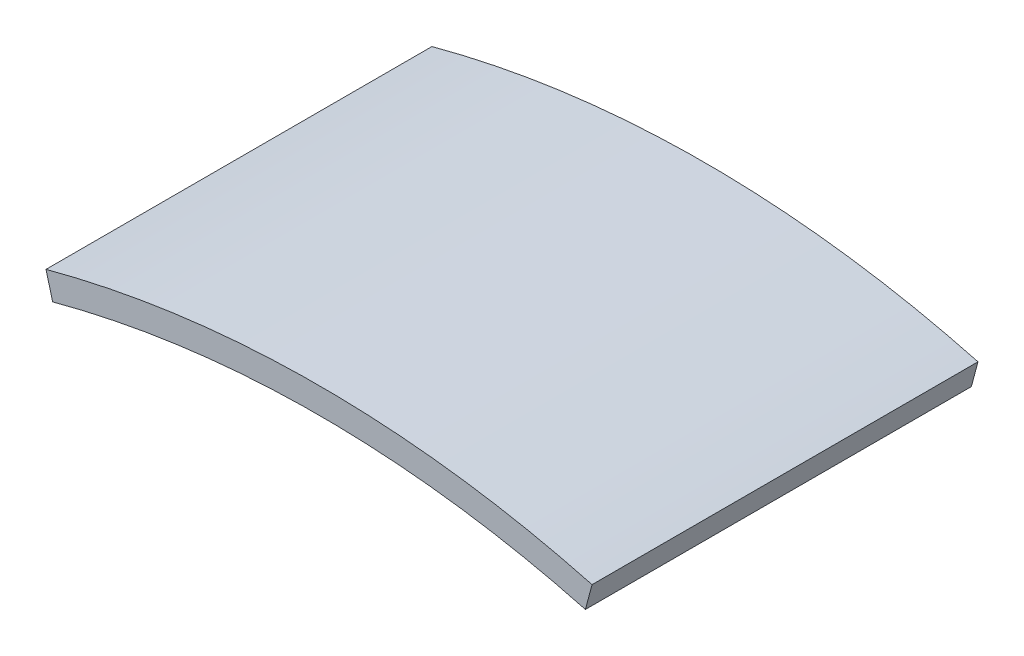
ISO-10303-21;
HEADER;
FILE_DESCRIPTION(('STEP AP214'),'2;1');
FILE_NAME('part.step','',(''),(''),'','','');
FILE_SCHEMA(('AUTOMOTIVE_DESIGN { 1 0 10303 214 1 1 1 1 }'));
ENDSEC;
DATA;
#1=APPLICATION_CONTEXT('core data for automotive mechanical design processes');
#2=APPLICATION_PROTOCOL_DEFINITION('international standard','automotive_design',2000,#1);
#3=PRODUCT_CONTEXT('',#1,'mechanical');
#4=PRODUCT('Part','Part','',(#3));
#5=PRODUCT_RELATED_PRODUCT_CATEGORY('part','',(#4));
#6=PRODUCT_DEFINITION_FORMATION('','',#4);
#7=PRODUCT_DEFINITION_CONTEXT('part definition',#1,'design');
#8=PRODUCT_DEFINITION('design','',#6,#7);
#9=PRODUCT_DEFINITION_SHAPE('','',#8);
#10=(LENGTH_UNIT() NAMED_UNIT(*) SI_UNIT(.MILLI.,.METRE.));
#11=(NAMED_UNIT(*) PLANE_ANGLE_UNIT() SI_UNIT($,.RADIAN.));
#12=(NAMED_UNIT(*) SI_UNIT($,.STERADIAN.) SOLID_ANGLE_UNIT());
#13=UNCERTAINTY_MEASURE_WITH_UNIT(LENGTH_MEASURE(1.E-05),#10,'distance_accuracy_value','');
#14=(GEOMETRIC_REPRESENTATION_CONTEXT(3) GLOBAL_UNCERTAINTY_ASSIGNED_CONTEXT((#13)) GLOBAL_UNIT_ASSIGNED_CONTEXT((#10,
#11,#12)) REPRESENTATION_CONTEXT('',''));
#15=CARTESIAN_POINT('',(0.,0.,0.));
#16=DIRECTION('',(0.,0.,1.));
#17=DIRECTION('',(1.,0.,0.));
#18=AXIS2_PLACEMENT_3D('',#15,#16,#17);
#19=CARTESIAN_POINT('',(40.,0.,15.));
#20=DIRECTION('',(0.,0.,-1.));
#21=DIRECTION('',(-1.,0.,0.));
#22=AXIS2_PLACEMENT_3D('',#19,#20,#21);
#23=CYLINDRICAL_SURFACE('',#22,41.);
#24=CARTESIAN_POINT('',(40.,0.,0.));
#25=DIRECTION('',(0.,0.,1.));
#26=DIRECTION('',(-1.,0.,0.));
#27=AXIS2_PLACEMENT_3D('',#24,#25,#26);
#28=CIRCLE('',#27,41.);
#29=CARTESIAN_POINT('',(50.6115808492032,39.6029588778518,0.));
#30=VERTEX_POINT('',#29);
#31=CARTESIAN_POINT('',(29.3884191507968,39.6029588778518,0.));
#32=VERTEX_POINT('',#31);
#33=EDGE_CURVE('E105',#30,#32,#28,.T.);
#34=ORIENTED_EDGE('',*,*,#33,.T.);
#35=DIRECTION('',(0.,0.,-1.));
#36=VECTOR('',#35,1.);
#37=CARTESIAN_POINT('',(29.3884191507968,39.6029588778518,15.));
#38=LINE('',#37,#36);
#39=CARTESIAN_POINT('',(29.3884191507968,39.6029588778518,15.));
#40=VERTEX_POINT('',#39);
#41=EDGE_CURVE('E100',#40,#32,#38,.T.);
#42=ORIENTED_EDGE('',*,*,#41,.F.);
#43=CARTESIAN_POINT('',(40.,0.,15.));
#44=DIRECTION('',(0.,0.,1.));
#45=DIRECTION('',(-1.,0.,0.));
#46=AXIS2_PLACEMENT_3D('',#43,#44,#45);
#47=CIRCLE('',#46,41.);
#48=CARTESIAN_POINT('',(50.6115808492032,39.6029588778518,15.));
#49=VERTEX_POINT('',#48);
#50=EDGE_CURVE('E126',#49,#40,#47,.T.);
#51=ORIENTED_EDGE('',*,*,#50,.F.);
#52=DIRECTION('',(0.,0.,-1.));
#53=VECTOR('',#52,1.);
#54=CARTESIAN_POINT('',(50.6115808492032,39.6029588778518,15.));
#55=LINE('',#54,#53);
#56=EDGE_CURVE('E121',#49,#30,#55,.T.);
#57=ORIENTED_EDGE('',*,*,#56,.T.);
#58=EDGE_LOOP('',(#34,#42,#51,#57));
#59=FACE_BOUND('',#58,.T.);
#60=ADVANCED_FACE('F36',(#59),#23,.T.);
#61=CARTESIAN_POINT('',(29.6472381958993,38.6370330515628,15.));
#62=DIRECTION('',(0.965925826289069,0.258819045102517,0.));
#63=DIRECTION('',(-0.258819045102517,0.965925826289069,0.));
#64=AXIS2_PLACEMENT_3D('',#61,#62,#63);
#65=PLANE('',#64);
#66=DIRECTION('',(0.258819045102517,-0.965925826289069,0.));
#67=VECTOR('',#66,1.);
#68=CARTESIAN_POINT('',(29.6472381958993,38.6370330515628,0.));
#69=LINE('',#68,#67);
#70=CARTESIAN_POINT('',(29.6472381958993,38.6370330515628,0.));
#71=VERTEX_POINT('',#70);
#72=EDGE_CURVE('E119',#32,#71,#69,.T.);
#73=ORIENTED_EDGE('',*,*,#72,.T.);
#74=DIRECTION('',(0.,0.,-1.));
#75=VECTOR('',#74,1.);
#76=CARTESIAN_POINT('',(29.6472381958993,38.6370330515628,15.));
#77=LINE('',#76,#75);
#78=CARTESIAN_POINT('',(29.6472381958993,38.6370330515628,15.));
#79=VERTEX_POINT('',#78);
#80=EDGE_CURVE('E117',#79,#71,#77,.T.);
#81=ORIENTED_EDGE('',*,*,#80,.F.);
#82=DIRECTION('',(0.258819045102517,-0.965925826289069,0.));
#83=VECTOR('',#82,1.);
#84=CARTESIAN_POINT('',(29.6472381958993,38.6370330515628,15.));
#85=LINE('',#84,#83);
#86=EDGE_CURVE('E91',#40,#79,#85,.T.);
#87=ORIENTED_EDGE('',*,*,#86,.F.);
#88=ORIENTED_EDGE('',*,*,#41,.T.);
#89=EDGE_LOOP('',(#73,#81,#87,#88));
#90=FACE_BOUND('',#89,.T.);
#91=ADVANCED_FACE('F110',(#90),#65,.F.);
#92=CARTESIAN_POINT('',(40.,0.,15.));
#93=DIRECTION('',(0.,0.,-1.));
#94=DIRECTION('',(-1.,0.,0.));
#95=AXIS2_PLACEMENT_3D('',#92,#93,#94);
#96=CYLINDRICAL_SURFACE('',#95,40.);
#97=CARTESIAN_POINT('',(40.,40.,5.00000152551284));
#98=CARTESIAN_POINT('',(39.8597206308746,39.9999989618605,5.0001626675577));
#99=CARTESIAN_POINT('',(39.7193561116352,39.9992541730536,5.01215823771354));
#100=CARTESIAN_POINT('',(39.4425290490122,39.9963554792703,5.05952823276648));
#101=CARTESIAN_POINT('',(39.3060712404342,39.9941999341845,5.0949298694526));
#102=CARTESIAN_POINT('',(39.041107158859,39.9887243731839,5.18809109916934));
#103=CARTESIAN_POINT('',(38.9125967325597,39.9854049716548,5.24583889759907));
#104=CARTESIAN_POINT('',(38.6671267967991,39.9779757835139,5.38203416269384));
#105=CARTESIAN_POINT('',(38.5501646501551,39.9738661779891,5.46047688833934));
#106=CARTESIAN_POINT('',(38.3309027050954,39.9653123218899,5.63596407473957));
#107=CARTESIAN_POINT('',(38.2286224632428,39.9608676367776,5.73303295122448));
#108=CARTESIAN_POINT('',(38.0417946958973,39.9521488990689,5.94296647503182));
#109=CARTESIAN_POINT('',(37.9572479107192,39.9478748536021,6.05583178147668));
#110=CARTESIAN_POINT('',(37.8082274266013,39.9399765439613,6.29426431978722));
#111=CARTESIAN_POINT('',(37.7437698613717,39.9363528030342,6.41984165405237));
#112=CARTESIAN_POINT('',(37.6368606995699,39.9301697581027,6.68006247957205));
#113=CARTESIAN_POINT('',(37.5944088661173,39.9276104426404,6.8147058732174));
#114=CARTESIAN_POINT('',(37.532770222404,39.9238492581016,7.08904835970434));
#115=CARTESIAN_POINT('',(37.5135527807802,39.9226456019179,7.22874054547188));
#116=CARTESIAN_POINT('',(37.4988340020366,39.9217262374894,7.50937275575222));
#117=CARTESIAN_POINT('',(37.5033323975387,39.9220105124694,7.65031276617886));
#118=CARTESIAN_POINT('',(37.5358920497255,39.9240332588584,7.92923247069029));
#119=CARTESIAN_POINT('',(37.5639203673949,39.925769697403,8.06721602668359));
#120=CARTESIAN_POINT('',(37.6426933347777,39.9304977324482,8.33651603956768));
#121=CARTESIAN_POINT('',(37.6934381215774,39.9334893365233,8.46783245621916));
#122=CARTESIAN_POINT('',(37.8162416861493,39.9403926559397,8.72017772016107));
#123=CARTESIAN_POINT('',(37.8883156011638,39.9443050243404,8.84119918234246));
#124=CARTESIAN_POINT('',(38.0517204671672,39.9526078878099,9.06943838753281));
#125=CARTESIAN_POINT('',(38.1430516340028,39.9569983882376,9.17665597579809));
#126=CARTESIAN_POINT('',(38.3425646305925,39.9657712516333,9.37443573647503));
#127=CARTESIAN_POINT('',(38.4507749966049,39.9701535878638,9.4649691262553));
#128=CARTESIAN_POINT('',(38.6808742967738,39.9784084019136,9.62658881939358));
#129=CARTESIAN_POINT('',(38.8027632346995,39.9822808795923,9.69767511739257));
#130=CARTESIAN_POINT('',(39.0567757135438,39.9890791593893,9.81837955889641));
#131=CARTESIAN_POINT('',(39.1888996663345,39.9920049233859,9.8679968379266));
#132=CARTESIAN_POINT('',(39.4596248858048,39.9965787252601,9.94433664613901));
#133=CARTESIAN_POINT('',(39.5982260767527,39.9982267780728,9.97105944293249));
#134=CARTESIAN_POINT('',(39.8777209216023,40.0000567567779,10.0008163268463));
#135=CARTESIAN_POINT('',(40.0186103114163,40.0002411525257,10.0038903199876));
#136=CARTESIAN_POINT('',(40.2989025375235,39.9991287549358,9.98636645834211));
#137=CARTESIAN_POINT('',(40.4383053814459,39.9978319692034,9.9657687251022));
#138=CARTESIAN_POINT('',(40.7115566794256,39.9939039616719,9.90151897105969));
#139=CARTESIAN_POINT('',(40.8454093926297,39.9912737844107,9.85788499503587));
#140=CARTESIAN_POINT('',(41.1038920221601,39.9849740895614,9.74881966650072));
#141=CARTESIAN_POINT('',(41.2285218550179,39.9813045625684,9.68338811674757));
#142=CARTESIAN_POINT('',(41.4652044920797,39.9733315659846,9.53248262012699));
#143=CARTESIAN_POINT('',(41.5772401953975,39.9690272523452,9.44698189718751));
#144=CARTESIAN_POINT('',(41.7853823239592,39.9602713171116,9.25840430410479));
#145=CARTESIAN_POINT('',(41.8814885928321,39.9558196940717,9.155327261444));
#146=CARTESIAN_POINT('',(42.0551781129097,39.9472631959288,8.93435135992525));
#147=CARTESIAN_POINT('',(42.132735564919,39.9431588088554,8.81643220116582));
#148=CARTESIAN_POINT('',(42.2669495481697,39.9357668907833,8.56922172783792));
#149=CARTESIAN_POINT('',(42.3236062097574,39.9324793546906,8.4399304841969));
#150=CARTESIAN_POINT('',(42.4143650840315,39.9270950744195,8.17374200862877));
#151=CARTESIAN_POINT('',(42.4484838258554,39.9249974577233,8.03685043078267));
#152=CARTESIAN_POINT('',(42.4932524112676,39.9222269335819,7.75926820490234));
#153=CARTESIAN_POINT('',(42.503902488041,39.921554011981,7.61857759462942));
#154=CARTESIAN_POINT('',(42.5014295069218,39.921709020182,7.3376485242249));
#155=CARTESIAN_POINT('',(42.4883471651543,39.9225343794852,7.19740970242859));
#156=CARTESIAN_POINT('',(42.4388649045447,39.925587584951,6.92112408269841));
#157=CARTESIAN_POINT('',(42.4024649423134,39.9278154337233,6.78507729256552));
#158=CARTESIAN_POINT('',(42.3073894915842,39.9334221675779,6.52103030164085));
#159=CARTESIAN_POINT('',(42.2487139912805,39.9368010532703,6.39303010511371));
#160=CARTESIAN_POINT('',(42.1107586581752,39.9443293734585,6.14869250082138));
#161=CARTESIAN_POINT('',(42.0314793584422,39.9484787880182,6.0323547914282));
#162=CARTESIAN_POINT('',(41.8544158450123,39.9570893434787,5.81443789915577));
#163=CARTESIAN_POINT('',(41.7566021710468,39.9615509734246,5.71288267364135));
#164=CARTESIAN_POINT('',(41.545286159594,39.970279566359,5.52759879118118));
#165=CARTESIAN_POINT('',(41.4317799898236,39.9745464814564,5.44387450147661));
#166=CARTESIAN_POINT('',(41.1921722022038,39.9824099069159,5.29656779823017));
#167=CARTESIAN_POINT('',(41.0660552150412,39.9860055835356,5.23301036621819));
#168=CARTESIAN_POINT('',(40.8050093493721,39.992110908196,5.12805042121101));
#169=CARTESIAN_POINT('',(40.6700910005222,39.994621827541,5.08662196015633));
#170=CARTESIAN_POINT('',(40.4452897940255,39.9976175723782,5.03784715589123));
#171=CARTESIAN_POINT('',(40.356852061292,39.9985070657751,5.02358686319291));
#172=CARTESIAN_POINT('',(40.1789544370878,39.9996986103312,5.00461265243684));
#173=CARTESIAN_POINT('',(40.0894945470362,40.0000006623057,4.99989872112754));
#174=CARTESIAN_POINT('',(40.,40.,5.00000152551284));
#175=B_SPLINE_CURVE_WITH_KNOTS('',3,(#97,#98,#99,#100,#101,#102,#103,#104,#105,#106,#107,#108,
#109,#110,#111,#112,#113,#114,#115,#116,#117,#118,#119,#120,#121,#122,#123,#124,#125,#126,#127,
#128,#129,#130,#131,#132,#133,#134,#135,#136,#137,#138,#139,#140,#141,#142,#143,#144,#145,#146,
#147,#148,#149,#150,#151,#152,#153,#154,#155,#156,#157,#158,#159,#160,#161,#162,#163,#164,#165,
#166,#167,#168,#169,#170,#171,#172,#173,#174),.UNSPECIFIED.,.T.,.F.,(4,2,2,2,2,2,2,2,2,2,2,2,2,
2,2,2,2,2,2,2,2,2,2,2,2,2,2,2,2,2,2,2,2,2,2,2,2,2,4),(0.,0.420511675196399,0.841513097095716,
1.26229261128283,1.68297581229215,2.10421427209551,2.5254703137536,2.94706380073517,
3.3686527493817,3.78968528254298,4.21071306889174,4.63115244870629,5.05159436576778,
5.47233538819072,5.89308112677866,6.31454605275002,6.73601109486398,7.1574931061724,
7.57897019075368,7.99973590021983,8.42049944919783,8.84093389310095,9.26137214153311,
9.6823745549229,10.103381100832,10.5249698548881,10.9465559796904,11.367832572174,
11.7891049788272,12.2096553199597,12.6302064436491,13.0507577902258,13.4712982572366,
13.8925128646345,14.3138305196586,14.7356680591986,15.1570098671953,15.4252856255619,
15.6935610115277),.UNSPECIFIED.);
#176=CARTESIAN_POINT('',(40.,40.,9.99999847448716));
#177=VERTEX_POINT('',#176);
#178=CARTESIAN_POINT('',(40.,40.,5.00000152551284));
#179=VERTEX_POINT('',#178);
#180=EDGE_CURVE('E39',#177,#179,#175,.T.);
#181=ORIENTED_EDGE('',*,*,#180,.T.);
#182=EDGE_CURVE('E11',#179,#177,#175,.T.);
#183=ORIENTED_EDGE('',*,*,#182,.T.);
#184=EDGE_LOOP('',(#181,#183));
#185=FACE_BOUND('',#184,.T.);
#186=CARTESIAN_POINT('',(40.,0.,0.));
#187=DIRECTION('',(0.,0.,-1.));
#188=DIRECTION('',(-1.,0.,0.));
#189=AXIS2_PLACEMENT_3D('',#186,#187,#188);
#190=CIRCLE('',#189,40.);
#191=CARTESIAN_POINT('',(50.3527618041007,38.6370330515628,0.));
#192=VERTEX_POINT('',#191);
#193=EDGE_CURVE('E114',#71,#192,#190,.T.);
#194=ORIENTED_EDGE('',*,*,#193,.T.);
#195=DIRECTION('',(0.,0.,-1.));
#196=VECTOR('',#195,1.);
#197=CARTESIAN_POINT('',(50.3527618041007,38.6370330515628,15.));
#198=LINE('',#197,#196);
#199=CARTESIAN_POINT('',(50.3527618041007,38.6370330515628,15.));
#200=VERTEX_POINT('',#199);
#201=EDGE_CURVE('E116',#200,#192,#198,.T.);
#202=ORIENTED_EDGE('',*,*,#201,.F.);
#203=CARTESIAN_POINT('',(40.,0.,15.));
#204=DIRECTION('',(0.,0.,-1.));
#205=DIRECTION('',(-1.,0.,0.));
#206=AXIS2_PLACEMENT_3D('',#203,#204,#205);
#207=CIRCLE('',#206,40.);
#208=EDGE_CURVE('E138',#79,#200,#207,.T.);
#209=ORIENTED_EDGE('',*,*,#208,.F.);
#210=ORIENTED_EDGE('',*,*,#80,.T.);
#211=EDGE_LOOP('',(#194,#202,#209,#210));
#212=FACE_BOUND('',#211,.T.);
#213=ADVANCED_FACE('F106',(#185,#212),#96,.F.);
#214=CARTESIAN_POINT('',(50.3527618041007,38.6370330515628,15.));
#215=DIRECTION('',(-0.965925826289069,0.258819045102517,0.));
#216=DIRECTION('',(-0.258819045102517,-0.965925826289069,0.));
#217=AXIS2_PLACEMENT_3D('',#214,#215,#216);
#218=PLANE('',#217);
#219=DIRECTION('',(0.258819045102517,0.965925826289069,0.));
#220=VECTOR('',#219,1.);
#221=CARTESIAN_POINT('',(50.3527618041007,38.6370330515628,0.));
#222=LINE('',#221,#220);
#223=EDGE_CURVE('E83',#192,#30,#222,.T.);
#224=ORIENTED_EDGE('',*,*,#223,.T.);
#225=ORIENTED_EDGE('',*,*,#56,.F.);
#226=DIRECTION('',(0.258819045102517,0.965925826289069,0.));
#227=VECTOR('',#226,1.);
#228=CARTESIAN_POINT('',(50.3527618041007,38.6370330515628,15.));
#229=LINE('',#228,#227);
#230=EDGE_CURVE('E62',#200,#49,#229,.T.);
#231=ORIENTED_EDGE('',*,*,#230,.F.);
#232=ORIENTED_EDGE('',*,*,#201,.T.);
#233=EDGE_LOOP('',(#224,#225,#231,#232));
#234=FACE_BOUND('',#233,.T.);
#235=ADVANCED_FACE('F109',(#234),#218,.F.);
#236=CARTESIAN_POINT('',(40.,0.,15.));
#237=DIRECTION('',(0.,0.,-1.));
#238=DIRECTION('',(-1.,0.,0.));
#239=AXIS2_PLACEMENT_3D('',#236,#237,#238);
#240=PLANE('',#239);
#241=ORIENTED_EDGE('',*,*,#50,.T.);
#242=ORIENTED_EDGE('',*,*,#86,.T.);
#243=ORIENTED_EDGE('',*,*,#208,.T.);
#244=ORIENTED_EDGE('',*,*,#230,.T.);
#245=EDGE_LOOP('',(#241,#242,#243,#244));
#246=FACE_BOUND('',#245,.T.);
#247=ADVANCED_FACE('F140',(#246),#240,.F.);
#248=CARTESIAN_POINT('',(40.,0.,0.));
#249=DIRECTION('',(0.,0.,-1.));
#250=DIRECTION('',(-1.,0.,0.));
#251=AXIS2_PLACEMENT_3D('',#248,#249,#250);
#252=PLANE('',#251);
#253=ORIENTED_EDGE('',*,*,#33,.F.);
#254=ORIENTED_EDGE('',*,*,#223,.F.);
#255=ORIENTED_EDGE('',*,*,#193,.F.);
#256=ORIENTED_EDGE('',*,*,#72,.F.);
#257=EDGE_LOOP('',(#253,#254,#255,#256));
#258=FACE_BOUND('',#257,.T.);
#259=ADVANCED_FACE('F124',(#258),#252,.T.);
#260=CARTESIAN_POINT('',(40.0027618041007,39.9,7.5));
#261=DIRECTION('',(0.,1.,0.));
#262=DIRECTION('',(0.,0.,1.));
#263=AXIS2_PLACEMENT_3D('',#260,#261,#262);
#264=CYLINDRICAL_SURFACE('',#263,2.5);
#265=CARTESIAN_POINT('',(40.0027618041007,40.,7.5));
#266=DIRECTION('',(0.,1.,0.));
#267=DIRECTION('',(0.,0.,1.));
#268=AXIS2_PLACEMENT_3D('',#265,#266,#267);
#269=CIRCLE('',#268,2.5);
#270=EDGE_CURVE('E53',#179,#177,#269,.T.);
#271=ORIENTED_EDGE('',*,*,#270,.T.);
#272=ORIENTED_EDGE('',*,*,#182,.F.);
#273=EDGE_LOOP('',(#271,#272));
#274=FACE_BOUND('',#273,.T.);
#275=ADVANCED_FACE('F104',(#274),#264,.F.);
#276=EDGE_CURVE('E97',#177,#179,#269,.T.);
#277=ORIENTED_EDGE('',*,*,#276,.T.);
#278=ORIENTED_EDGE('',*,*,#180,.F.);
#279=EDGE_LOOP('',(#277,#278));
#280=FACE_BOUND('',#279,.T.);
#281=ADVANCED_FACE('F96',(#280),#264,.F.);
#282=CARTESIAN_POINT('',(40.0027618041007,40.,7.5));
#283=DIRECTION('',(0.,1.,0.));
#284=DIRECTION('',(0.,0.,1.));
#285=AXIS2_PLACEMENT_3D('',#282,#283,#284);
#286=PLANE('',#285);
#287=ORIENTED_EDGE('',*,*,#276,.F.);
#288=ORIENTED_EDGE('',*,*,#270,.F.);
#289=EDGE_LOOP('',(#287,#288));
#290=FACE_BOUND('',#289,.T.);
#291=ADVANCED_FACE('F101',(#290),#286,.F.);
#292=CLOSED_SHELL('',(#60,#91,#213,#235,#247,#259,#275,#281,#291));
#293=MANIFOLD_SOLID_BREP('B2',#292);
#294=ADVANCED_BREP_SHAPE_REPRESENTATION('',(#18,#293),#14);
#295=SHAPE_DEFINITION_REPRESENTATION(#9,#294);
ENDSEC;
END-ISO-10303-21;
